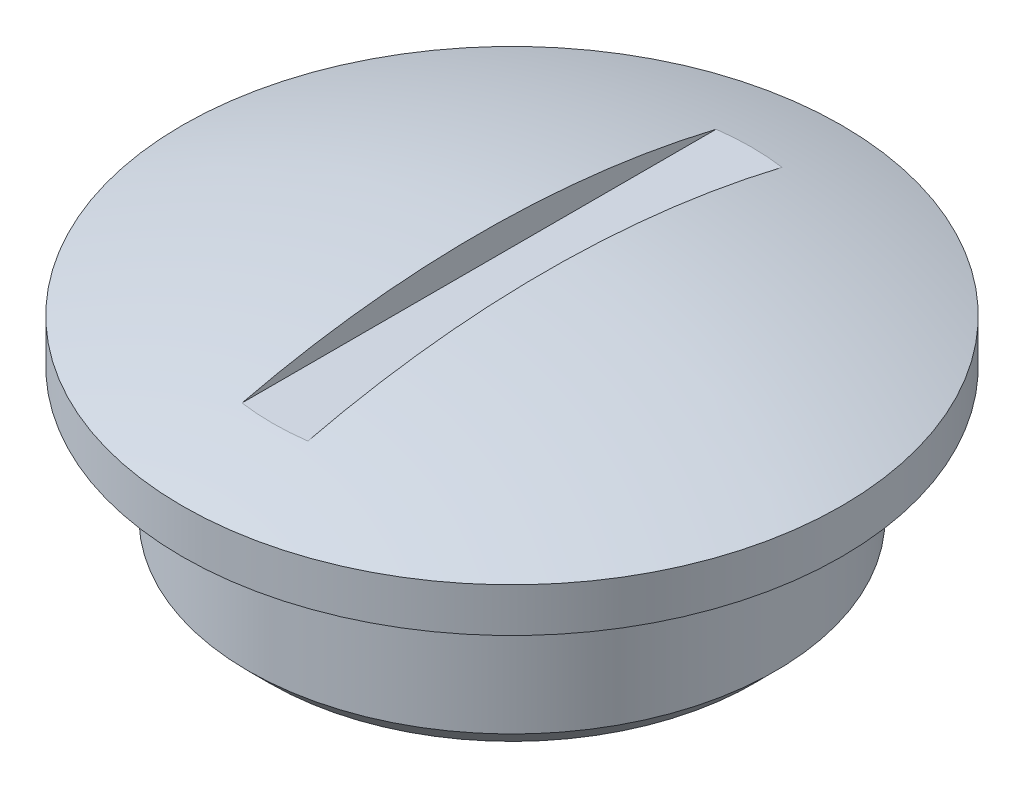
ISO-10303-21;
HEADER;
FILE_DESCRIPTION(('STEP AP214'),'2;1');
FILE_NAME('part.step','',(''),(''),'','','');
FILE_SCHEMA(('AUTOMOTIVE_DESIGN { 1 0 10303 214 1 1 1 1 }'));
ENDSEC;
DATA;
#1=APPLICATION_CONTEXT('core data for automotive mechanical design processes');
#2=APPLICATION_PROTOCOL_DEFINITION('international standard','automotive_design',2000,#1);
#3=PRODUCT_CONTEXT('',#1,'mechanical');
#4=PRODUCT('Part','Part','',(#3));
#5=PRODUCT_RELATED_PRODUCT_CATEGORY('part','',(#4));
#6=PRODUCT_DEFINITION_FORMATION('','',#4);
#7=PRODUCT_DEFINITION_CONTEXT('part definition',#1,'design');
#8=PRODUCT_DEFINITION('design','',#6,#7);
#9=PRODUCT_DEFINITION_SHAPE('','',#8);
#10=(LENGTH_UNIT() NAMED_UNIT(*) SI_UNIT(.MILLI.,.METRE.));
#11=(NAMED_UNIT(*) PLANE_ANGLE_UNIT() SI_UNIT($,.RADIAN.));
#12=(NAMED_UNIT(*) SI_UNIT($,.STERADIAN.) SOLID_ANGLE_UNIT());
#13=UNCERTAINTY_MEASURE_WITH_UNIT(LENGTH_MEASURE(1.E-05),#10,'distance_accuracy_value','');
#14=(GEOMETRIC_REPRESENTATION_CONTEXT(3) GLOBAL_UNCERTAINTY_ASSIGNED_CONTEXT((#13)) GLOBAL_UNIT_ASSIGNED_CONTEXT((#10,
#11,#12)) REPRESENTATION_CONTEXT('',''));
#15=CARTESIAN_POINT('',(0.,0.,0.));
#16=DIRECTION('',(0.,0.,1.));
#17=DIRECTION('',(1.,0.,0.));
#18=AXIS2_PLACEMENT_3D('',#15,#16,#17);
#19=CARTESIAN_POINT('',(0.,-7.,0.));
#20=DIRECTION('',(0.,1.,0.));
#21=DIRECTION('',(0.,0.,1.));
#22=AXIS2_PLACEMENT_3D('',#19,#20,#21);
#23=CYLINDRICAL_SURFACE('',#22,12.);
#24=CARTESIAN_POINT('',(0.,-1.5,0.));
#25=DIRECTION('',(0.,-1.,0.));
#26=DIRECTION('',(0.,0.,-1.));
#27=AXIS2_PLACEMENT_3D('',#24,#25,#26);
#28=CIRCLE('',#27,12.);
#29=CARTESIAN_POINT('',(0.,-1.5,-12.));
#30=VERTEX_POINT('',#29);
#31=EDGE_CURVE('E100',#30,#30,#28,.T.);
#32=ORIENTED_EDGE('',*,*,#31,.T.);
#33=EDGE_LOOP('',(#32));
#34=FACE_BOUND('',#33,.T.);
#35=CARTESIAN_POINT('',(0.,-6.,0.));
#36=DIRECTION('',(0.,1.,0.));
#37=DIRECTION('',(0.,0.,1.));
#38=AXIS2_PLACEMENT_3D('',#35,#36,#37);
#39=CIRCLE('',#38,12.);
#40=CARTESIAN_POINT('',(0.,-6.,12.));
#41=VERTEX_POINT('',#40);
#42=EDGE_CURVE('E86',#41,#41,#39,.T.);
#43=ORIENTED_EDGE('',*,*,#42,.T.);
#44=EDGE_LOOP('',(#43));
#45=FACE_BOUND('',#44,.T.);
#46=ADVANCED_FACE('F42',(#34,#45),#23,.T.);
#47=CARTESIAN_POINT('',(0.,-7.,0.));
#48=DIRECTION('',(0.,1.,0.));
#49=DIRECTION('',(0.,0.,1.));
#50=AXIS2_PLACEMENT_3D('',#47,#48,#49);
#51=PLANE('',#50);
#52=CARTESIAN_POINT('',(0.,-7.,0.));
#53=DIRECTION('',(0.,1.,0.));
#54=DIRECTION('',(0.,0.,1.));
#55=AXIS2_PLACEMENT_3D('',#52,#53,#54);
#56=CIRCLE('',#55,11.);
#57=CARTESIAN_POINT('',(0.,-7.,11.));
#58=VERTEX_POINT('',#57);
#59=EDGE_CURVE('E82',#58,#58,#56,.F.);
#60=ORIENTED_EDGE('',*,*,#59,.T.);
#61=EDGE_LOOP('',(#60));
#62=FACE_BOUND('',#61,.T.);
#63=CARTESIAN_POINT('',(0.,-7.,0.));
#64=DIRECTION('',(0.,1.,0.));
#65=DIRECTION('',(0.,0.,1.));
#66=AXIS2_PLACEMENT_3D('',#63,#64,#65);
#67=CIRCLE('',#66,9.);
#68=CARTESIAN_POINT('',(0.,-7.,9.));
#69=VERTEX_POINT('',#68);
#70=EDGE_CURVE('E78',#69,#69,#67,.T.);
#71=ORIENTED_EDGE('',*,*,#70,.T.);
#72=EDGE_LOOP('',(#71));
#73=FACE_BOUND('',#72,.T.);
#74=ADVANCED_FACE('F132',(#62,#73),#51,.F.);
#75=CARTESIAN_POINT('',(0.,-41.75,0.));
#76=DIRECTION('',(0.,0.,1.));
#77=DIRECTION('',(1.,0.,0.));
#78=AXIS2_PLACEMENT_3D('',#75,#76,#77);
#79=SPHERICAL_SURFACE('',#78,43.25);
#80=CARTESIAN_POINT('',(0.,-41.75,0.));
#81=DIRECTION('',(0.,-1.,0.));
#82=DIRECTION('',(0.,0.,-1.));
#83=AXIS2_PLACEMENT_3D('',#80,#81,#82);
#84=SPHERICAL_SURFACE('',#83,43.25);
#85=CARTESIAN_POINT('',(0.,0.55322091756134,0.));
#86=DIRECTION('',(0.,-1.,0.));
#87=DIRECTION('',(0.,0.,-1.));
#88=AXIS2_PLACEMENT_3D('',#85,#86,#87);
#89=CIRCLE('',#88,9.);
#90=CARTESIAN_POINT('',(0.,0.55322091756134,-9.));
#91=VERTEX_POINT('',#90);
#92=EDGE_CURVE('E95',#91,#91,#89,.F.);
#93=ORIENTED_EDGE('',*,*,#92,.F.);
#94=EDGE_LOOP('',(#93));
#95=FACE_BOUND('',#94,.T.);
#96=ADVANCED_FACE('F138',(#95),#84,.F.);
#97=CARTESIAN_POINT('',(0.,-7.,0.));
#98=DIRECTION('',(0.,1.,0.));
#99=DIRECTION('',(0.,0.,1.));
#100=AXIS2_PLACEMENT_3D('',#97,#98,#99);
#101=CYLINDRICAL_SURFACE('',#100,9.);
#102=ORIENTED_EDGE('',*,*,#92,.T.);
#103=EDGE_LOOP('',(#102));
#104=FACE_BOUND('',#103,.T.);
#105=ORIENTED_EDGE('',*,*,#70,.F.);
#106=EDGE_LOOP('',(#105));
#107=FACE_BOUND('',#106,.T.);
#108=ADVANCED_FACE('F155',(#104,#107),#101,.F.);
#109=CARTESIAN_POINT('',(0.,-6.,0.));
#110=DIRECTION('',(0.,1.,0.));
#111=DIRECTION('',(0.,0.,1.));
#112=AXIS2_PLACEMENT_3D('',#109,#110,#111);
#113=CONICAL_SURFACE('',#112,12.,0.78539816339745);
#114=ORIENTED_EDGE('',*,*,#59,.F.);
#115=EDGE_LOOP('',(#114));
#116=FACE_BOUND('',#115,.T.);
#117=ORIENTED_EDGE('',*,*,#42,.F.);
#118=EDGE_LOOP('',(#117));
#119=FACE_BOUND('',#118,.T.);
#120=ADVANCED_FACE('F44',(#116,#119),#113,.T.);
#121=CARTESIAN_POINT('',(0.,-1.5,0.));
#122=DIRECTION('',(0.,-1.,0.));
#123=DIRECTION('',(0.,0.,-1.));
#124=AXIS2_PLACEMENT_3D('',#121,#122,#123);
#125=PLANE('',#124);
#126=ORIENTED_EDGE('',*,*,#31,.F.);
#127=EDGE_LOOP('',(#126));
#128=FACE_BOUND('',#127,.T.);
#129=CARTESIAN_POINT('',(0.,-1.5,0.));
#130=DIRECTION('',(0.,-1.,0.));
#131=DIRECTION('',(1.,0.,0.));
#132=AXIS2_PLACEMENT_3D('',#129,#130,#131);
#133=CIRCLE('',#132,11.);
#134=CARTESIAN_POINT('',(11.,-1.5,0.));
#135=VERTEX_POINT('',#134);
#136=EDGE_CURVE('E104',#135,#135,#133,.T.);
#137=ORIENTED_EDGE('',*,*,#136,.T.);
#138=EDGE_LOOP('',(#137));
#139=FACE_BOUND('',#138,.T.);
#140=ADVANCED_FACE('F111',(#128,#139),#125,.F.);
#141=CARTESIAN_POINT('',(0.,-1.5,0.));
#142=DIRECTION('',(0.,1.,0.));
#143=DIRECTION('',(0.,0.,1.));
#144=AXIS2_PLACEMENT_3D('',#141,#142,#143);
#145=CYLINDRICAL_SURFACE('',#144,11.);
#146=ORIENTED_EDGE('',*,*,#136,.F.);
#147=EDGE_LOOP('',(#146));
#148=FACE_BOUND('',#147,.T.);
#149=CARTESIAN_POINT('',(0.,0.,0.));
#150=DIRECTION('',(0.,-1.,0.));
#151=DIRECTION('',(1.,0.,0.));
#152=AXIS2_PLACEMENT_3D('',#149,#150,#151);
#153=CIRCLE('',#152,11.);
#154=CARTESIAN_POINT('',(11.,0.,0.));
#155=VERTEX_POINT('',#154);
#156=EDGE_CURVE('E105',#155,#155,#153,.T.);
#157=ORIENTED_EDGE('',*,*,#156,.T.);
#158=EDGE_LOOP('',(#157));
#159=FACE_BOUND('',#158,.T.);
#160=ADVANCED_FACE('F113',(#148,#159),#145,.T.);
#161=CARTESIAN_POINT('',(1.5,6.5439035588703,-15.));
#162=DIRECTION('',(1.,0.,0.));
#163=DIRECTION('',(0.,1.,0.));
#164=AXIS2_PLACEMENT_3D('',#161,#162,#163);
#165=PLANE('',#164);
#166=CARTESIAN_POINT('',(1.50000000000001,-41.75,0.));
#167=DIRECTION('',(1.,0.,0.));
#168=DIRECTION('',(0.,1.,0.));
#169=AXIS2_PLACEMENT_3D('',#166,#167,#168);
#170=CIRCLE('',#169,46.2256692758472);
#171=CARTESIAN_POINT('',(1.5,3.2,10.7847114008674));
#172=VERTEX_POINT('',#171);
#173=CARTESIAN_POINT('',(1.5,3.2,-10.7847114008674));
#174=VERTEX_POINT('',#173);
#175=EDGE_CURVE('E76',#172,#174,#170,.F.);
#176=ORIENTED_EDGE('',*,*,#175,.T.);
#177=DIRECTION('',(0.,0.,1.));
#178=VECTOR('',#177,1.);
#179=CARTESIAN_POINT('',(1.5,3.2,-15.));
#180=LINE('',#179,#178);
#181=EDGE_CURVE('E58',#174,#172,#180,.T.);
#182=ORIENTED_EDGE('',*,*,#181,.T.);
#183=EDGE_LOOP('',(#176,#182));
#184=FACE_BOUND('',#183,.T.);
#185=ADVANCED_FACE('F75',(#184),#165,.F.);
#186=CARTESIAN_POINT('',(-1.5,6.5439035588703,-15.));
#187=DIRECTION('',(-1.,0.,0.));
#188=DIRECTION('',(0.,-1.,0.));
#189=AXIS2_PLACEMENT_3D('',#186,#187,#188);
#190=PLANE('',#189);
#191=CARTESIAN_POINT('',(-1.50000000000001,-41.75,0.));
#192=DIRECTION('',(-1.,0.,0.));
#193=DIRECTION('',(0.,-1.,0.));
#194=AXIS2_PLACEMENT_3D('',#191,#192,#193);
#195=CIRCLE('',#194,46.2256692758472);
#196=CARTESIAN_POINT('',(-1.5,3.2,-10.7847114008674));
#197=VERTEX_POINT('',#196);
#198=CARTESIAN_POINT('',(-1.5,3.2,10.7847114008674));
#199=VERTEX_POINT('',#198);
#200=EDGE_CURVE('E46',#197,#199,#195,.F.);
#201=ORIENTED_EDGE('',*,*,#200,.T.);
#202=DIRECTION('',(0.,0.,1.));
#203=VECTOR('',#202,1.);
#204=CARTESIAN_POINT('',(-1.5,3.2,-15.));
#205=LINE('',#204,#203);
#206=EDGE_CURVE('E71',#197,#199,#205,.T.);
#207=ORIENTED_EDGE('',*,*,#206,.F.);
#208=EDGE_LOOP('',(#201,#207));
#209=FACE_BOUND('',#208,.T.);
#210=ADVANCED_FACE('F146',(#209),#190,.F.);
#211=CARTESIAN_POINT('',(-1.5,3.2,-15.));
#212=DIRECTION('',(0.,-1.,0.));
#213=DIRECTION('',(0.,0.,-1.));
#214=AXIS2_PLACEMENT_3D('',#211,#212,#213);
#215=PLANE('',#214);
#216=CARTESIAN_POINT('',(0.,3.2,0.));
#217=DIRECTION('',(0.,-1.,0.));
#218=DIRECTION('',(0.,0.,-1.));
#219=AXIS2_PLACEMENT_3D('',#216,#217,#218);
#220=CIRCLE('',#219,10.8885260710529);
#221=EDGE_CURVE('E12',#199,#172,#220,.F.);
#222=ORIENTED_EDGE('',*,*,#221,.T.);
#223=ORIENTED_EDGE('',*,*,#181,.F.);
#224=EDGE_CURVE('E52',#174,#197,#220,.F.);
#225=ORIENTED_EDGE('',*,*,#224,.T.);
#226=ORIENTED_EDGE('',*,*,#206,.T.);
#227=EDGE_LOOP('',(#222,#223,#225,#226));
#228=FACE_BOUND('',#227,.T.);
#229=ADVANCED_FACE('F70',(#228),#215,.F.);
#230=CARTESIAN_POINT('',(0.,-41.75,0.));
#231=DIRECTION('',(0.,0.,1.));
#232=DIRECTION('',(1.,0.,0.));
#233=AXIS2_PLACEMENT_3D('',#230,#231,#232);
#234=SPHERICAL_SURFACE('',#233,46.25);
#235=ORIENTED_EDGE('',*,*,#221,.F.);
#236=ORIENTED_EDGE('',*,*,#200,.F.);
#237=ORIENTED_EDGE('',*,*,#224,.F.);
#238=ORIENTED_EDGE('',*,*,#175,.F.);
#239=EDGE_LOOP('',(#235,#236,#237,#238));
#240=FACE_BOUND('',#239,.T.);
#241=CARTESIAN_POINT('',(0.,2.,0.));
#242=DIRECTION('',(0.,1.,0.));
#243=DIRECTION('',(0.,0.,1.));
#244=AXIS2_PLACEMENT_3D('',#241,#242,#243);
#245=CIRCLE('',#244,15.);
#246=CARTESIAN_POINT('',(0.,2.,15.));
#247=VERTEX_POINT('',#246);
#248=EDGE_CURVE('E89',#247,#247,#245,.T.);
#249=ORIENTED_EDGE('',*,*,#248,.T.);
#250=EDGE_LOOP('',(#249));
#251=FACE_BOUND('',#250,.T.);
#252=ADVANCED_FACE('F80',(#240,#251),#234,.T.);
#253=CARTESIAN_POINT('',(0.,2.,0.));
#254=DIRECTION('',(0.,-1.,0.));
#255=DIRECTION('',(0.,0.,-1.));
#256=AXIS2_PLACEMENT_3D('',#253,#254,#255);
#257=CYLINDRICAL_SURFACE('',#256,15.);
#258=ORIENTED_EDGE('',*,*,#248,.F.);
#259=EDGE_LOOP('',(#258));
#260=FACE_BOUND('',#259,.T.);
#261=CARTESIAN_POINT('',(0.,0.,0.));
#262=DIRECTION('',(0.,1.,0.));
#263=DIRECTION('',(0.,0.,1.));
#264=AXIS2_PLACEMENT_3D('',#261,#262,#263);
#265=CIRCLE('',#264,15.);
#266=CARTESIAN_POINT('',(0.,0.,15.));
#267=VERTEX_POINT('',#266);
#268=EDGE_CURVE('E92',#267,#267,#265,.T.);
#269=ORIENTED_EDGE('',*,*,#268,.T.);
#270=EDGE_LOOP('',(#269));
#271=FACE_BOUND('',#270,.T.);
#272=ADVANCED_FACE('F121',(#260,#271),#257,.T.);
#273=CARTESIAN_POINT('',(0.,0.,0.));
#274=DIRECTION('',(0.,1.,0.));
#275=DIRECTION('',(0.,0.,1.));
#276=AXIS2_PLACEMENT_3D('',#273,#274,#275);
#277=PLANE('',#276);
#278=ORIENTED_EDGE('',*,*,#268,.F.);
#279=EDGE_LOOP('',(#278));
#280=FACE_BOUND('',#279,.T.);
#281=ORIENTED_EDGE('',*,*,#156,.F.);
#282=EDGE_LOOP('',(#281));
#283=FACE_BOUND('',#282,.T.);
#284=ADVANCED_FACE('F119',(#280,#283),#277,.F.);
#285=CLOSED_SHELL('',(#46,#74,#96,#108,#120,#140,#160,#185,#210,#229,#252,#272,#284));
#286=MANIFOLD_SOLID_BREP('B2',#285);
#287=ADVANCED_BREP_SHAPE_REPRESENTATION('',(#18,#286),#14);
#288=SHAPE_DEFINITION_REPRESENTATION(#9,#287);
ENDSEC;
END-ISO-10303-21;
